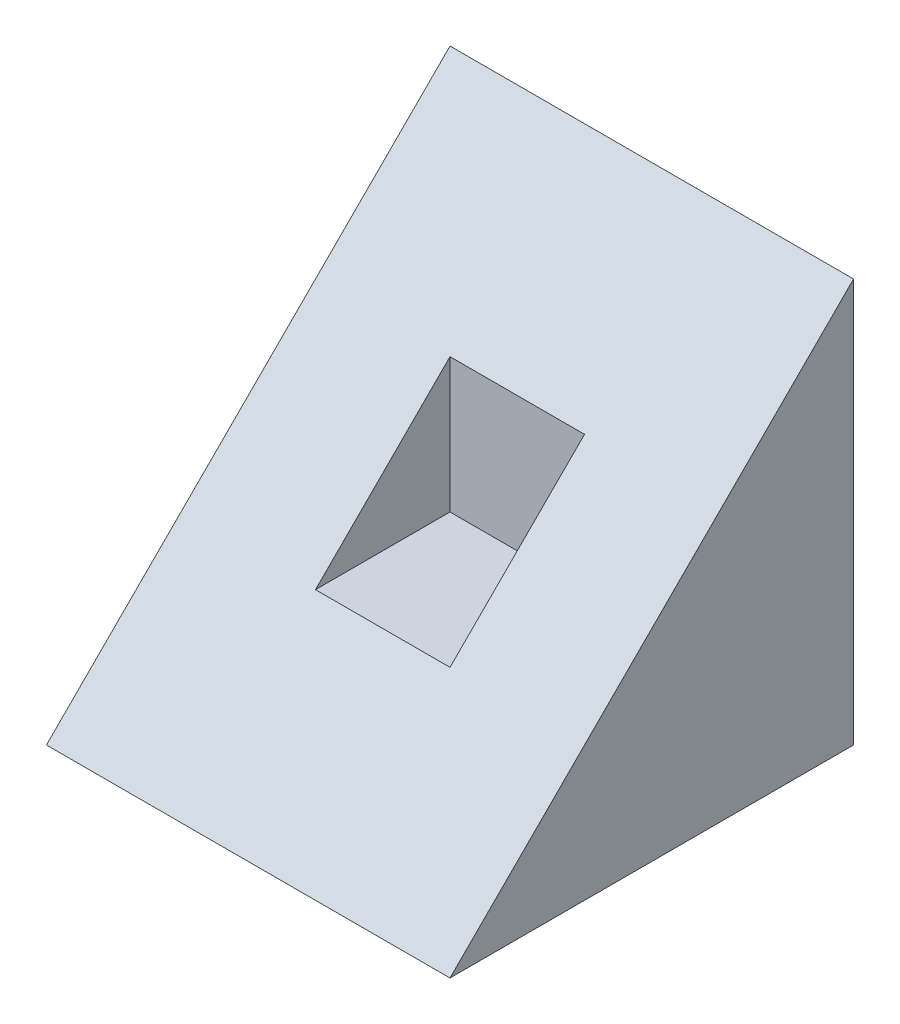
from build123d import *

# Parameters (mm, degrees)
BOSS_EXTRUDE1_DEPTH = 76.2
SKETCH3_W           = 50.8
SKETCH3_H           = 50.8
CUT_EXTRUDE1_DEPTH  = 25.4


with BuildPart() as part:
    # Sketch2 → Boss-Extrude1 (new, symmetric)
    with BuildSketch(Plane(origin=(0, 0, 0), x_dir=(0, 0, -1), z_dir=(1, 0, 0))):
        Polygon((76.2, 76.2), (-76.2, -76.2), (76.2, -76.2), align=None)
    extrude(amount=BOSS_EXTRUDE1_DEPTH, both=True)

    # Sketch3 → Cut-Extrude1 (cut, symmetric)
    with BuildSketch(Plane(origin=(0, 0, 0), x_dir=(1, 0, 0), z_dir=(0, 1, 0))):
        Rectangle(SKETCH3_W, SKETCH3_H)
    extrude(amount=CUT_EXTRUDE1_DEPTH, both=True, mode=Mode.SUBTRACT)


solid = part.part
